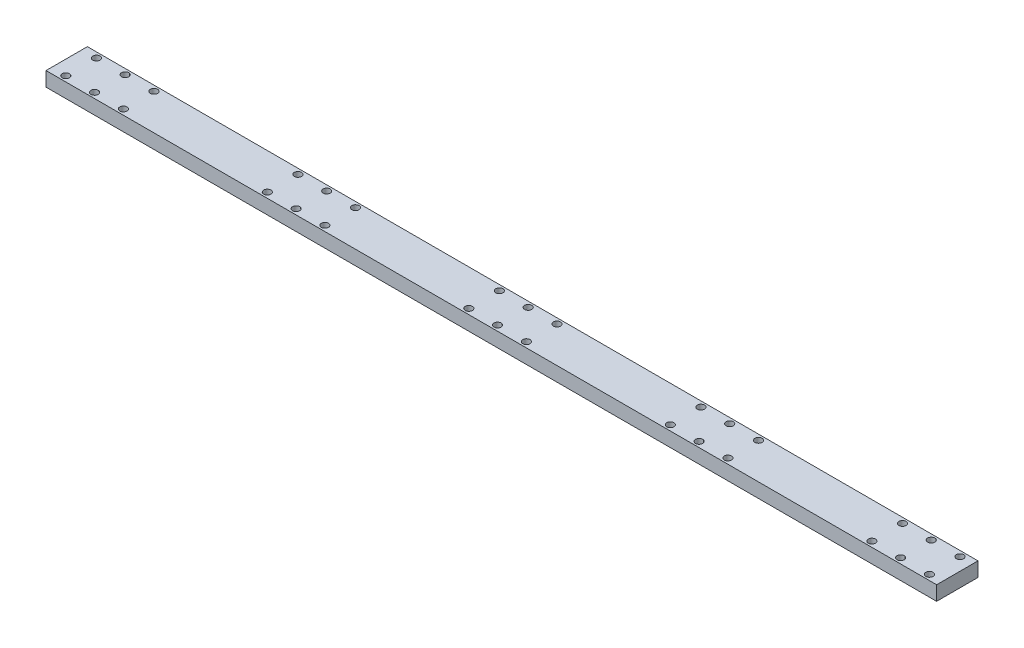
from build123d import *

# Parameters (mm, degrees)
SKETCH_1_W      = 495
SKETCH_1_H      = 23
SKETCH_1_R      = 2
EXTRUDE_1_DEPTH = 8


with BuildPart() as part:
    # Sketch 1 → Extrude 1 (new body)
    with BuildSketch(Plane(origin=(0, 0, 0), x_dir=(1, 0, 0), z_dir=(0, 1, 0))):
        with Locations((227.3, 2.4)):
            Rectangle(SKETCH_1_W, SKETCH_1_H)
        with Locations(Location((-12.2, 10.9, 0), (0, 0, 270))):
            Circle(SKETCH_1_R, mode=Mode.SUBTRACT)
        with Locations(Location((3.8, 10.9, 0), (0, 0, 270))):
            Circle(SKETCH_1_R, mode=Mode.SUBTRACT)
        with Locations(Location((19.8, 10.9, 0), (0, 0, 270))):
            Circle(SKETCH_1_R, mode=Mode.SUBTRACT)
        with Locations(Location((-12.2, -6.1, 0), (0, 0, 270))):
            Circle(SKETCH_1_R, mode=Mode.SUBTRACT)
        with Locations(Location((3.8, -6.1, 0), (0, 0, 270))):
            Circle(SKETCH_1_R, mode=Mode.SUBTRACT)
        with Locations(Location((19.8, -6.1, 0), (0, 0, 270))):
            Circle(SKETCH_1_R, mode=Mode.SUBTRACT)
        with Locations(Location((99.8, 10.9, 0), (0, 0, 270))):
            Circle(SKETCH_1_R, mode=Mode.SUBTRACT)
        with Locations(Location((115.8, 10.9, 0), (0, 0, 270))):
            Circle(SKETCH_1_R, mode=Mode.SUBTRACT)
        with Locations(Location((131.8, 10.9, 0), (0, 0, 270))):
            Circle(SKETCH_1_R, mode=Mode.SUBTRACT)
        with Locations(Location((99.8, -6.1, 0), (0, 0, 270))):
            Circle(SKETCH_1_R, mode=Mode.SUBTRACT)
        with Locations(Location((115.8, -6.1, 0), (0, 0, 270))):
            Circle(SKETCH_1_R, mode=Mode.SUBTRACT)
        with Locations(Location((131.8, -6.1, 0), (0, 0, 270))):
            Circle(SKETCH_1_R, mode=Mode.SUBTRACT)
        with Locations(Location((211.8, 10.9, 0), (0, 0, 270))):
            Circle(SKETCH_1_R, mode=Mode.SUBTRACT)
        with Locations(Location((227.8, 10.9, 0), (0, 0, 270))):
            Circle(SKETCH_1_R, mode=Mode.SUBTRACT)
        with Locations(Location((243.8, 10.9, 0), (0, 0, 270))):
            Circle(SKETCH_1_R, mode=Mode.SUBTRACT)
        with Locations(Location((211.8, -6.1, 0), (0, 0, 270))):
            Circle(SKETCH_1_R, mode=Mode.SUBTRACT)
        with Locations(Location((227.8, -6.1, 0), (0, 0, 270))):
            Circle(SKETCH_1_R, mode=Mode.SUBTRACT)
        with Locations(Location((243.8, -6.1, 0), (0, 0, 270))):
            Circle(SKETCH_1_R, mode=Mode.SUBTRACT)
        with Locations(Location((323.8, 10.9, 0), (0, 0, 270))):
            Circle(SKETCH_1_R, mode=Mode.SUBTRACT)
        with Locations(Location((339.8, 10.9, 0), (0, 0, 270))):
            Circle(SKETCH_1_R, mode=Mode.SUBTRACT)
        with Locations(Location((355.8, 10.9, 0), (0, 0, 270))):
            Circle(SKETCH_1_R, mode=Mode.SUBTRACT)
        with Locations(Location((323.8, -6.1, 0), (0, 0, 270))):
            Circle(SKETCH_1_R, mode=Mode.SUBTRACT)
        with Locations(Location((339.8, -6.1, 0), (0, 0, 270))):
            Circle(SKETCH_1_R, mode=Mode.SUBTRACT)
        with Locations(Location((355.8, -6.1, 0), (0, 0, 270))):
            Circle(SKETCH_1_R, mode=Mode.SUBTRACT)
        with Locations(Location((435.8, 10.9, 0), (0, 0, 270))):
            Circle(SKETCH_1_R, mode=Mode.SUBTRACT)
        with Locations(Location((451.8, 10.9, 0), (0, 0, 270))):
            Circle(SKETCH_1_R, mode=Mode.SUBTRACT)
        with Locations(Location((467.8, 10.9, 0), (0, 0, 270))):
            Circle(SKETCH_1_R, mode=Mode.SUBTRACT)
        with Locations(Location((435.8, -6.1, 0), (0, 0, 270))):
            Circle(SKETCH_1_R, mode=Mode.SUBTRACT)
        with Locations(Location((451.8, -6.1, 0), (0, 0, 270))):
            Circle(SKETCH_1_R, mode=Mode.SUBTRACT)
        with Locations(Location((467.8, -6.1, 0), (0, 0, 270))):
            Circle(SKETCH_1_R, mode=Mode.SUBTRACT)
    extrude(amount=EXTRUDE_1_DEPTH)


solid = part.part
